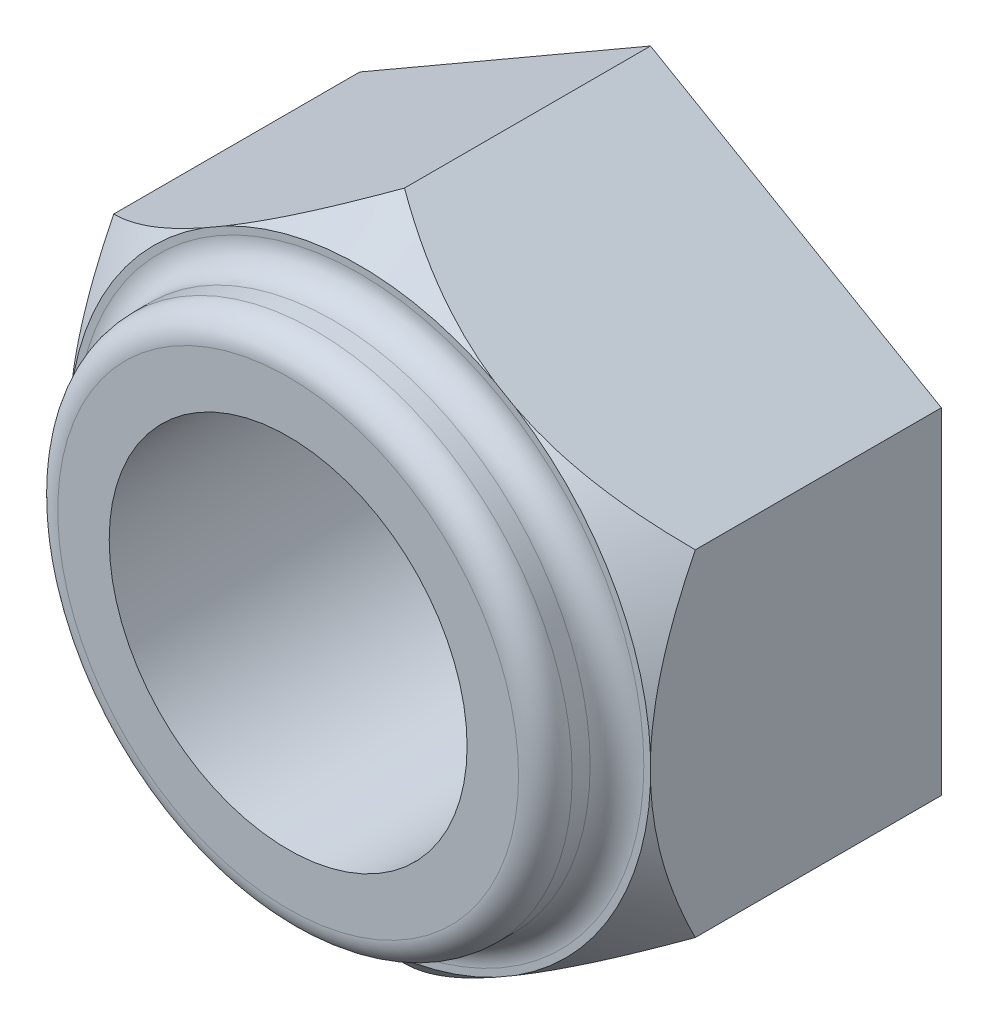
from build123d import *

# Parameters (mm, degrees)
ESQUISSE1_R          = 4
BASE_EXTRUSION_DEPTH = 6.5
EXTRUSION1_START     = 1.6
ESQUISSE3_R          = 5.75
ESQUISSE3_R_2        = 4
EXTRUSION1_DEPTH     = 1.6
CONG_1_R             = 0.6


with BuildPart() as part:
    # Esquisse1 → Base-Extrusion (new body)
    with BuildSketch(Plane.XY):
        Polygon((0, 7.505553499), (-6.5, 3.75277675), (-6.5, -3.75277675), (0, -7.505553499), (6.5, -3.75277675), (6.5, 3.75277675), align=None)
        Circle(ESQUISSE1_R, mode=Mode.SUBTRACT)
    extrude(amount=-BASE_EXTRUSION_DEPTH)

    # Esquisse3 → Extrusion1 (add)
    with BuildSketch(Plane.XY.offset(EXTRUSION1_START)):
        Circle(ESQUISSE3_R)
        Circle(ESQUISSE3_R_2, mode=Mode.SUBTRACT)
    extrude(amount=-EXTRUSION1_DEPTH)

    # Cong_1
    cong_1_edges = [part.edges().sort_by_distance(p)[0] for p in [
        (-5.75, 0, 1.6),
        (-5.75, 0, 0),
    ]]
    fillet(cong_1_edges, radius=CONG_1_R)

    # Esquisse2 → Enl_vement de mati_re-R_volution1 (revolve, cut)
    with BuildSketch(Plane(origin=(0, 0, 0), x_dir=(0, 0, -1), z_dir=(1, 0, 0))):
        Polygon((0, 7.505553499), (1, 7.505553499), (0, 6.505553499), align=None)
    revolve(axis=Axis((0, 0, 0), (0, 0, -1)), mode=Mode.SUBTRACT)


solid = part.part
